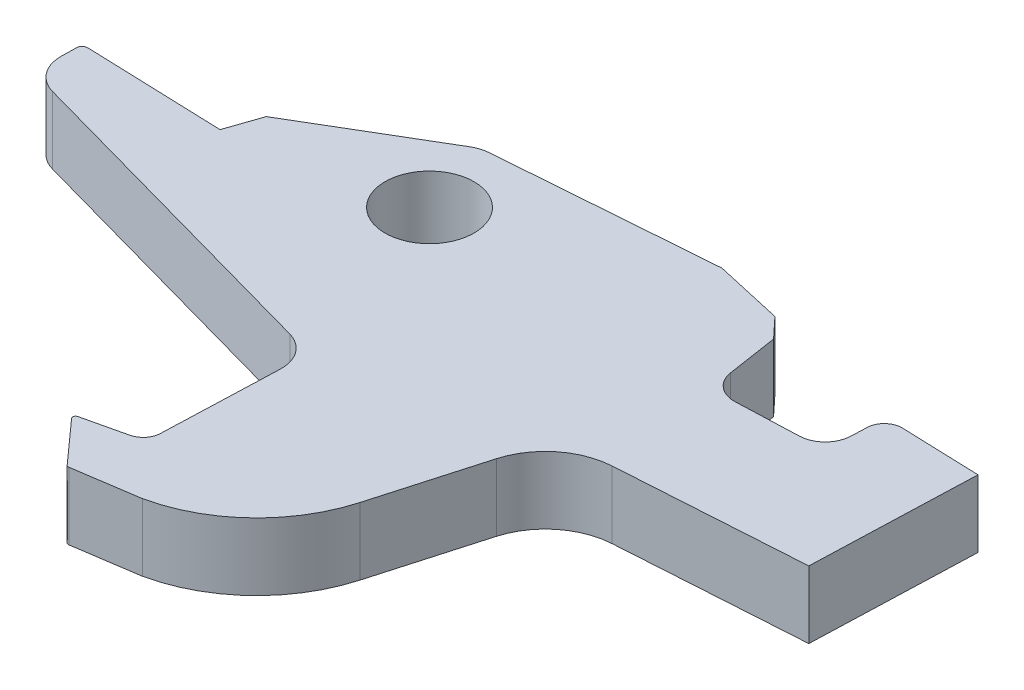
ISO-10303-21;
HEADER;
FILE_DESCRIPTION(('STEP AP214'),'2;1');
FILE_NAME('part.step','',(''),(''),'','','');
FILE_SCHEMA(('AUTOMOTIVE_DESIGN { 1 0 10303 214 1 1 1 1 }'));
ENDSEC;
DATA;
#1=APPLICATION_CONTEXT('core data for automotive mechanical design processes');
#2=APPLICATION_PROTOCOL_DEFINITION('international standard','automotive_design',2000,#1);
#3=PRODUCT_CONTEXT('',#1,'mechanical');
#4=PRODUCT('Part','Part','',(#3));
#5=PRODUCT_RELATED_PRODUCT_CATEGORY('part','',(#4));
#6=PRODUCT_DEFINITION_FORMATION('','',#4);
#7=PRODUCT_DEFINITION_CONTEXT('part definition',#1,'design');
#8=PRODUCT_DEFINITION('design','',#6,#7);
#9=PRODUCT_DEFINITION_SHAPE('','',#8);
#10=(LENGTH_UNIT() NAMED_UNIT(*) SI_UNIT(.MILLI.,.METRE.));
#11=(NAMED_UNIT(*) PLANE_ANGLE_UNIT() SI_UNIT($,.RADIAN.));
#12=(NAMED_UNIT(*) SI_UNIT($,.STERADIAN.) SOLID_ANGLE_UNIT());
#13=UNCERTAINTY_MEASURE_WITH_UNIT(LENGTH_MEASURE(1.E-05),#10,'distance_accuracy_value','');
#14=(GEOMETRIC_REPRESENTATION_CONTEXT(3) GLOBAL_UNCERTAINTY_ASSIGNED_CONTEXT((#13)) GLOBAL_UNIT_ASSIGNED_CONTEXT((#10,
#11,#12)) REPRESENTATION_CONTEXT('',''));
#15=CARTESIAN_POINT('',(0.,0.,0.));
#16=DIRECTION('',(0.,0.,1.));
#17=DIRECTION('',(1.,0.,0.));
#18=AXIS2_PLACEMENT_3D('',#15,#16,#17);
#19=CARTESIAN_POINT('',(-14.0248582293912,1.4986,1.70336053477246));
#20=DIRECTION('',(-0.999851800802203,0.,-0.0172155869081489));
#21=DIRECTION('',(-0.0172155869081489,0.,0.999851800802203));
#22=AXIS2_PLACEMENT_3D('',#19,#20,#21);
#23=PLANE('',#22);
#24=DIRECTION('',(-0.0172155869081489,0.,0.999851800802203));
#25=VECTOR('',#24,1.);
#26=CARTESIAN_POINT('',(-14.0248582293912,1.4986,1.70336053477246));
#27=LINE('',#26,#25);
#28=CARTESIAN_POINT('',(-14.0362916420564,1.4986,2.36739355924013));
#29=VERTEX_POINT('',#28);
#30=CARTESIAN_POINT('',(-14.0248582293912,1.4986,1.70336053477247));
#31=VERTEX_POINT('',#30);
#32=EDGE_CURVE('E227',#29,#31,#27,.F.);
#33=ORIENTED_EDGE('',*,*,#32,.T.);
#34=DIRECTION('',(0.,1.,0.));
#35=VECTOR('',#34,1.);
#36=CARTESIAN_POINT('',(-14.0248582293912,0.,1.70336053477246));
#37=LINE('',#36,#35);
#38=CARTESIAN_POINT('',(-14.0248582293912,-1.4986,1.70336053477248));
#39=VERTEX_POINT('',#38);
#40=EDGE_CURVE('E144',#39,#31,#37,.T.);
#41=ORIENTED_EDGE('',*,*,#40,.F.);
#42=DIRECTION('',(-0.0172155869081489,0.,0.999851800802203));
#43=VECTOR('',#42,1.);
#44=CARTESIAN_POINT('',(-14.0248582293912,-1.4986,1.70336053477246));
#45=LINE('',#44,#43);
#46=CARTESIAN_POINT('',(-14.0362916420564,-1.4986,2.36739355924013));
#47=VERTEX_POINT('',#46);
#48=EDGE_CURVE('E229',#39,#47,#45,.T.);
#49=ORIENTED_EDGE('',*,*,#48,.T.);
#50=DIRECTION('',(0.,-1.,0.));
#51=VECTOR('',#50,1.);
#52=CARTESIAN_POINT('',(-14.0362916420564,0.,2.3673935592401));
#53=LINE('',#52,#51);
#54=EDGE_CURVE('E141',#29,#47,#53,.T.);
#55=ORIENTED_EDGE('',*,*,#54,.F.);
#56=EDGE_LOOP('',(#33,#41,#49,#55));
#57=FACE_BOUND('',#56,.T.);
#58=ADVANCED_FACE('F16',(#57),#23,.T.);
#59=CARTESIAN_POINT('',(18.240471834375,1.4986,-1.25608519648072));
#60=DIRECTION('',(-0.999390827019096,0.,-0.034899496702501));
#61=DIRECTION('',(-0.034899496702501,0.,0.999390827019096));
#62=AXIS2_PLACEMENT_3D('',#59,#60,#61);
#63=PLANE('',#62);
#64=DIRECTION('',(-0.034899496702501,0.,0.999390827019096));
#65=VECTOR('',#64,1.);
#66=CARTESIAN_POINT('',(18.240471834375,1.4986,-1.25608519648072));
#67=LINE('',#66,#65);
#68=CARTESIAN_POINT('',(18.2163151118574,1.4986,-0.56432717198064));
#69=VERTEX_POINT('',#68);
#70=CARTESIAN_POINT('',(18.240471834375,1.4986,-1.25608519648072));
#71=VERTEX_POINT('',#70);
#72=EDGE_CURVE('E124',#69,#71,#67,.F.);
#73=ORIENTED_EDGE('',*,*,#72,.T.);
#74=DIRECTION('',(0.,1.,0.));
#75=VECTOR('',#74,1.);
#76=CARTESIAN_POINT('',(18.240471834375,0.,-1.25608519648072));
#77=LINE('',#76,#75);
#78=CARTESIAN_POINT('',(18.240471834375,-1.4986,-1.25608519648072));
#79=VERTEX_POINT('',#78);
#80=EDGE_CURVE('E136',#79,#71,#77,.T.);
#81=ORIENTED_EDGE('',*,*,#80,.F.);
#82=DIRECTION('',(-0.034899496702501,0.,0.999390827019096));
#83=VECTOR('',#82,1.);
#84=CARTESIAN_POINT('',(18.240471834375,-1.4986,-1.25608519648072));
#85=LINE('',#84,#83);
#86=CARTESIAN_POINT('',(18.2163151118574,-1.4986,-0.56432717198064));
#87=VERTEX_POINT('',#86);
#88=EDGE_CURVE('E138',#79,#87,#85,.T.);
#89=ORIENTED_EDGE('',*,*,#88,.T.);
#90=DIRECTION('',(0.,-1.,0.));
#91=VECTOR('',#90,1.);
#92=CARTESIAN_POINT('',(18.2163151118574,0.,-0.564327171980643));
#93=LINE('',#92,#91);
#94=EDGE_CURVE('E137',#69,#87,#93,.T.);
#95=ORIENTED_EDGE('',*,*,#94,.F.);
#96=EDGE_LOOP('',(#73,#81,#89,#95));
#97=FACE_BOUND('',#96,.T.);
#98=ADVANCED_FACE('F134',(#97),#63,.T.);
#99=CARTESIAN_POINT('',(19.0337383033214,1.49860000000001,-1.22838372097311));
#100=DIRECTION('',(0.,-1.,0.));
#101=DIRECTION('',(0.,0.,-1.));
#102=AXIS2_PLACEMENT_3D('',#99,#100,#101);
#103=CYLINDRICAL_SURFACE('',#102,0.793749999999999);
#104=DIRECTION('',(0.,1.,0.));
#105=VECTOR('',#104,1.);
#106=CARTESIAN_POINT('',(19.061439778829,1.4986,-2.02165018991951));
#107=LINE('',#106,#105);
#108=CARTESIAN_POINT('',(19.061439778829,-1.4986,-2.02165018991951));
#109=VERTEX_POINT('',#108);
#110=CARTESIAN_POINT('',(19.061439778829,1.4986,-2.02165018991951));
#111=VERTEX_POINT('',#110);
#112=EDGE_CURVE('E175',#109,#111,#107,.T.);
#113=ORIENTED_EDGE('',*,*,#112,.F.);
#114=CARTESIAN_POINT('',(19.0337383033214,-1.4986,-1.22838372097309));
#115=DIRECTION('',(0.,-1.,0.));
#116=DIRECTION('',(0.,0.,-1.));
#117=AXIS2_PLACEMENT_3D('',#114,#115,#116);
#118=CIRCLE('',#117,0.793749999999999);
#119=EDGE_CURVE('E20',#109,#79,#118,.F.);
#120=ORIENTED_EDGE('',*,*,#119,.T.);
#121=ORIENTED_EDGE('',*,*,#80,.T.);
#122=CARTESIAN_POINT('',(19.0337383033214,1.49860000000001,-1.22838372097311));
#123=DIRECTION('',(0.,-1.,0.));
#124=DIRECTION('',(0.,0.,-1.));
#125=AXIS2_PLACEMENT_3D('',#122,#123,#124);
#126=CIRCLE('',#125,0.793749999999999);
#127=EDGE_CURVE('E119',#111,#71,#126,.F.);
#128=ORIENTED_EDGE('',*,*,#127,.F.);
#129=EDGE_LOOP('',(#113,#120,#121,#128));
#130=FACE_BOUND('',#129,.T.);
#131=ADVANCED_FACE('F140',(#130),#103,.T.);
#132=CARTESIAN_POINT('',(1.97043333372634,1.4986,17.9349846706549));
#133=DIRECTION('',(0.,-1.,0.));
#134=DIRECTION('',(0.,0.,-1.));
#135=AXIS2_PLACEMENT_3D('',#132,#133,#134);
#136=CYLINDRICAL_SURFACE('',#135,0.127000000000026);
#137=DIRECTION('',(0.,1.,0.));
#138=VECTOR('',#137,1.);
#139=CARTESIAN_POINT('',(1.87588424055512,1.4986,18.0197754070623));
#140=LINE('',#139,#138);
#141=CARTESIAN_POINT('',(1.87588424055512,-1.49860000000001,18.0197754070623));
#142=VERTEX_POINT('',#141);
#143=CARTESIAN_POINT('',(1.87588424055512,1.4986,18.0197754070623));
#144=VERTEX_POINT('',#143);
#145=EDGE_CURVE('E363',#142,#144,#140,.T.);
#146=ORIENTED_EDGE('',*,*,#145,.F.);
#147=CARTESIAN_POINT('',(1.97043333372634,-1.49860000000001,17.9349846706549));
#148=DIRECTION('',(0.,-1.,0.));
#149=DIRECTION('',(0.,0.,-1.));
#150=AXIS2_PLACEMENT_3D('',#147,#148,#149);
#151=CIRCLE('',#150,0.127000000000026);
#152=CARTESIAN_POINT('',(1.98924094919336,-1.49860000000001,18.0605843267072));
#153=VERTEX_POINT('',#152);
#154=EDGE_CURVE('E215',#142,#153,#151,.F.);
#155=ORIENTED_EDGE('',*,*,#154,.T.);
#156=DIRECTION('',(0.,1.,0.));
#157=VECTOR('',#156,1.);
#158=CARTESIAN_POINT('',(1.98924094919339,1.4986,18.0605843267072));
#159=LINE('',#158,#157);
#160=CARTESIAN_POINT('',(1.98924094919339,1.4986,18.0605843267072));
#161=VERTEX_POINT('',#160);
#162=EDGE_CURVE('E367',#161,#153,#159,.F.);
#163=ORIENTED_EDGE('',*,*,#162,.F.);
#164=CARTESIAN_POINT('',(1.97043333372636,1.49859999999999,17.934984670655));
#165=DIRECTION('',(0.,-1.,0.));
#166=DIRECTION('',(0.,0.,-1.));
#167=AXIS2_PLACEMENT_3D('',#164,#165,#166);
#168=CIRCLE('',#167,0.126999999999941);
#169=EDGE_CURVE('E172',#144,#161,#168,.F.);
#170=ORIENTED_EDGE('',*,*,#169,.F.);
#171=EDGE_LOOP('',(#146,#155,#163,#170));
#172=FACE_BOUND('',#171,.T.);
#173=ADVANCED_FACE('F550',(#172),#136,.T.);
#174=CARTESIAN_POINT('',(0.262221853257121,1.4986,16.0301793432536));
#175=DIRECTION('',(0.,-1.,0.));
#176=DIRECTION('',(0.,0.,-1.));
#177=AXIS2_PLACEMENT_3D('',#174,#175,#176);
#178=CYLINDRICAL_SURFACE('',#177,0.127000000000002);
#179=DIRECTION('',(0.,1.,0.));
#180=VECTOR('',#179,1.);
#181=CARTESIAN_POINT('',(0.23332514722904,1.4986,15.9065105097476));
#182=LINE('',#181,#180);
#183=CARTESIAN_POINT('',(0.233325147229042,-1.49860000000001,15.9065105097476));
#184=VERTEX_POINT('',#183);
#185=CARTESIAN_POINT('',(0.233325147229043,1.4986,15.9065105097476));
#186=VERTEX_POINT('',#185);
#187=EDGE_CURVE('E358',#184,#186,#182,.T.);
#188=ORIENTED_EDGE('',*,*,#187,.F.);
#189=CARTESIAN_POINT('',(0.262221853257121,-1.49860000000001,16.0301793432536));
#190=DIRECTION('',(0.,-1.,0.));
#191=DIRECTION('',(0.,0.,-1.));
#192=AXIS2_PLACEMENT_3D('',#189,#190,#191);
#193=CIRCLE('',#192,0.127000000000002);
#194=CARTESIAN_POINT('',(0.16767276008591,-1.49860000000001,16.1149700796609));
#195=VERTEX_POINT('',#194);
#196=EDGE_CURVE('E214',#184,#195,#193,.F.);
#197=ORIENTED_EDGE('',*,*,#196,.T.);
#198=DIRECTION('',(0.,1.,0.));
#199=VECTOR('',#198,1.);
#200=CARTESIAN_POINT('',(0.167672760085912,1.4986,16.1149700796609));
#201=LINE('',#200,#199);
#202=CARTESIAN_POINT('',(0.16767276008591,1.4986,16.1149700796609));
#203=VERTEX_POINT('',#202);
#204=EDGE_CURVE('E362',#203,#195,#201,.F.);
#205=ORIENTED_EDGE('',*,*,#204,.F.);
#206=CARTESIAN_POINT('',(0.262221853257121,1.4986,16.0301793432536));
#207=DIRECTION('',(0.,-1.,0.));
#208=DIRECTION('',(0.,0.,-1.));
#209=AXIS2_PLACEMENT_3D('',#206,#207,#208);
#210=CIRCLE('',#209,0.127000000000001);
#211=EDGE_CURVE('E176',#186,#203,#210,.F.);
#212=ORIENTED_EDGE('',*,*,#211,.F.);
#213=EDGE_LOOP('',(#188,#197,#205,#212));
#214=FACE_BOUND('',#213,.T.);
#215=ADVANCED_FACE('F544',(#214),#178,.T.);
#216=CARTESIAN_POINT('',(1.93628762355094,1.4986,14.6934623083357));
#217=DIRECTION('',(0.,-1.,0.));
#218=DIRECTION('',(0.,0.,-1.));
#219=AXIS2_PLACEMENT_3D('',#216,#217,#218);
#220=CYLINDRICAL_SURFACE('',#219,0.793750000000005);
#221=DIRECTION('',(0.,1.,0.));
#222=VECTOR('',#221,1.);
#223=CARTESIAN_POINT('',(2.72951488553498,1.4986,14.7222646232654));
#224=LINE('',#223,#222);
#225=CARTESIAN_POINT('',(2.72951488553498,-1.49860000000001,14.7222646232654));
#226=VERTEX_POINT('',#225);
#227=CARTESIAN_POINT('',(2.72951488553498,1.4986,14.7222646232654));
#228=VERTEX_POINT('',#227);
#229=EDGE_CURVE('E353',#226,#228,#224,.T.);
#230=ORIENTED_EDGE('',*,*,#229,.F.);
#231=CARTESIAN_POINT('',(1.93628762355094,-1.49860000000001,14.6934623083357));
#232=DIRECTION('',(0.,-1.,0.));
#233=DIRECTION('',(0.,0.,-1.));
#234=AXIS2_PLACEMENT_3D('',#231,#232,#233);
#235=CIRCLE('',#234,0.793750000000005);
#236=CARTESIAN_POINT('',(2.11689203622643,-1.49860000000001,15.466392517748));
#237=VERTEX_POINT('',#236);
#238=EDGE_CURVE('E212',#226,#237,#235,.T.);
#239=ORIENTED_EDGE('',*,*,#238,.T.);
#240=DIRECTION('',(0.,1.,0.));
#241=VECTOR('',#240,1.);
#242=CARTESIAN_POINT('',(2.11689203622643,1.4986,15.466392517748));
#243=LINE('',#242,#241);
#244=CARTESIAN_POINT('',(2.11689203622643,1.4986,15.466392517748));
#245=VERTEX_POINT('',#244);
#246=EDGE_CURVE('E357',#245,#237,#243,.F.);
#247=ORIENTED_EDGE('',*,*,#246,.F.);
#248=CARTESIAN_POINT('',(1.93628762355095,1.4986,14.6934623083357));
#249=DIRECTION('',(0.,-1.,0.));
#250=DIRECTION('',(0.,0.,-1.));
#251=AXIS2_PLACEMENT_3D('',#248,#249,#250);
#252=CIRCLE('',#251,0.793749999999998);
#253=EDGE_CURVE('E179',#228,#245,#252,.T.);
#254=ORIENTED_EDGE('',*,*,#253,.F.);
#255=EDGE_LOOP('',(#230,#239,#247,#254));
#256=FACE_BOUND('',#255,.T.);
#257=ADVANCED_FACE('F532',(#256),#220,.F.);
#258=CARTESIAN_POINT('',(1.34677931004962,1.4986,9.50915039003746));
#259=DIRECTION('',(0.,-1.,0.));
#260=DIRECTION('',(0.,0.,-1.));
#261=AXIS2_PLACEMENT_3D('',#258,#259,#260);
#262=CYLINDRICAL_SURFACE('',#261,1.57099000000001);
#263=DIRECTION('',(0.,1.,0.));
#264=VECTOR('',#263,1.);
#265=CARTESIAN_POINT('',(1.77146006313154,1.4986,7.99665052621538));
#266=LINE('',#265,#264);
#267=CARTESIAN_POINT('',(1.77146006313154,-1.49860000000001,7.99665052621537));
#268=VERTEX_POINT('',#267);
#269=CARTESIAN_POINT('',(1.77146006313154,1.4986,7.99665052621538));
#270=VERTEX_POINT('',#269);
#271=EDGE_CURVE('E348',#268,#270,#266,.T.);
#272=ORIENTED_EDGE('',*,*,#271,.F.);
#273=CARTESIAN_POINT('',(1.34677931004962,-1.49860000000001,9.50915039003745));
#274=DIRECTION('',(0.,-1.,0.));
#275=DIRECTION('',(0.,0.,-1.));
#276=AXIS2_PLACEMENT_3D('',#273,#274,#275);
#277=CIRCLE('',#276,1.57099000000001);
#278=CARTESIAN_POINT('',(2.91673470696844,-1.49860000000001,9.56615593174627));
#279=VERTEX_POINT('',#278);
#280=EDGE_CURVE('E210',#268,#279,#277,.T.);
#281=ORIENTED_EDGE('',*,*,#280,.T.);
#282=DIRECTION('',(0.,1.,0.));
#283=VECTOR('',#282,1.);
#284=CARTESIAN_POINT('',(2.91673470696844,1.4986,9.56615593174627));
#285=LINE('',#284,#283);
#286=CARTESIAN_POINT('',(2.91673470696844,1.4986,9.56615593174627));
#287=VERTEX_POINT('',#286);
#288=EDGE_CURVE('E352',#287,#279,#285,.F.);
#289=ORIENTED_EDGE('',*,*,#288,.F.);
#290=CARTESIAN_POINT('',(1.34677931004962,1.4986,9.50915039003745));
#291=DIRECTION('',(0.,-1.,0.));
#292=DIRECTION('',(1.,0.,0.));
#293=AXIS2_PLACEMENT_3D('',#290,#291,#292);
#294=CIRCLE('',#293,1.57099000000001);
#295=EDGE_CURVE('E182',#270,#287,#294,.T.);
#296=ORIENTED_EDGE('',*,*,#295,.F.);
#297=EDGE_LOOP('',(#272,#281,#289,#296));
#298=FACE_BOUND('',#297,.T.);
#299=ADVANCED_FACE('F524',(#298),#262,.F.);
#300=CARTESIAN_POINT('',(-12.4490269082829,1.4986,2.39472330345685));
#301=DIRECTION('',(0.,-1.,0.));
#302=DIRECTION('',(0.,0.,-1.));
#303=AXIS2_PLACEMENT_3D('',#300,#301,#302);
#304=CYLINDRICAL_SURFACE('',#303,1.5875);
#305=CARTESIAN_POINT('',(-12.4490269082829,-1.4986,2.39472330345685));
#306=DIRECTION('',(0.,-1.,0.));
#307=DIRECTION('',(0.,0.,-1.));
#308=AXIS2_PLACEMENT_3D('',#305,#306,#307);
#309=CIRCLE('',#308,1.5875);
#310=CARTESIAN_POINT('',(-12.874317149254,-1.4986,3.92419525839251));
#311=VERTEX_POINT('',#310);
#312=EDGE_CURVE('E208',#47,#311,#309,.F.);
#313=ORIENTED_EDGE('',*,*,#312,.T.);
#314=DIRECTION('',(0.,1.,0.));
#315=VECTOR('',#314,1.);
#316=CARTESIAN_POINT('',(-12.874317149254,1.4986,3.92419525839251));
#317=LINE('',#316,#315);
#318=CARTESIAN_POINT('',(-12.874317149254,1.4986,3.92419525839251));
#319=VERTEX_POINT('',#318);
#320=EDGE_CURVE('E255',#319,#311,#317,.F.);
#321=ORIENTED_EDGE('',*,*,#320,.F.);
#322=CARTESIAN_POINT('',(-12.4490269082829,1.4986,2.39472330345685));
#323=DIRECTION('',(0.,-1.,0.));
#324=DIRECTION('',(0.,0.,-1.));
#325=AXIS2_PLACEMENT_3D('',#322,#323,#324);
#326=CIRCLE('',#325,1.5875);
#327=EDGE_CURVE('E185',#29,#319,#326,.F.);
#328=ORIENTED_EDGE('',*,*,#327,.F.);
#329=ORIENTED_EDGE('',*,*,#54,.T.);
#330=EDGE_LOOP('',(#313,#321,#328,#329));
#331=FACE_BOUND('',#330,.T.);
#332=ADVANCED_FACE('F251',(#331),#304,.T.);
#333=CARTESIAN_POINT('',(-13.7708958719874,1.4986,1.70773329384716));
#334=DIRECTION('',(0.,-1.,0.));
#335=DIRECTION('',(0.,0.,-1.));
#336=AXIS2_PLACEMENT_3D('',#333,#334,#335);
#337=CYLINDRICAL_SURFACE('',#336,0.254000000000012);
#338=DIRECTION('',(0.,1.,0.));
#339=VECTOR('',#338,1.);
#340=CARTESIAN_POINT('',(-13.7620312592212,1.4986,1.45388802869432));
#341=LINE('',#340,#339);
#342=CARTESIAN_POINT('',(-13.7620312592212,-1.4986,1.45388802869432));
#343=VERTEX_POINT('',#342);
#344=CARTESIAN_POINT('',(-13.7620312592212,1.4986,1.45388802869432));
#345=VERTEX_POINT('',#344);
#346=EDGE_CURVE('E244',#343,#345,#341,.T.);
#347=ORIENTED_EDGE('',*,*,#346,.F.);
#348=CARTESIAN_POINT('',(-13.7708958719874,-1.4986,1.70773329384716));
#349=DIRECTION('',(0.,-1.,0.));
#350=DIRECTION('',(0.,0.,-1.));
#351=AXIS2_PLACEMENT_3D('',#348,#349,#350);
#352=CIRCLE('',#351,0.254000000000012);
#353=EDGE_CURVE('E206',#343,#39,#352,.F.);
#354=ORIENTED_EDGE('',*,*,#353,.T.);
#355=ORIENTED_EDGE('',*,*,#40,.T.);
#356=CARTESIAN_POINT('',(-13.7708958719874,1.4986,1.70773329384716));
#357=DIRECTION('',(0.,-1.,0.));
#358=DIRECTION('',(0.,0.,-1.));
#359=AXIS2_PLACEMENT_3D('',#356,#357,#358);
#360=CIRCLE('',#359,0.254000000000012);
#361=EDGE_CURVE('E188',#345,#31,#360,.F.);
#362=ORIENTED_EDGE('',*,*,#361,.F.);
#363=EDGE_LOOP('',(#347,#354,#355,#362));
#364=FACE_BOUND('',#363,.T.);
#365=ADVANCED_FACE('F239',(#364),#337,.T.);
#366=CARTESIAN_POINT('',(-7.13932422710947,1.4986,0.133090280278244));
#367=DIRECTION('',(-0.945734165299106,0.,-0.324941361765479));
#368=DIRECTION('',(-0.324941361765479,0.,0.945734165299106));
#369=AXIS2_PLACEMENT_3D('',#366,#367,#368);
#370=PLANE('',#369);
#371=DIRECTION('',(-0.324941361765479,0.,0.945734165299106));
#372=VECTOR('',#371,1.);
#373=CARTESIAN_POINT('',(-7.13932422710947,1.49860000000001,0.133090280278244));
#374=LINE('',#373,#372);
#375=CARTESIAN_POINT('',(-7.13932422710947,1.4986,0.133090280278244));
#376=VERTEX_POINT('',#375);
#377=CARTESIAN_POINT('',(-7.66627222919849,1.4986,1.66676000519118));
#378=VERTEX_POINT('',#377);
#379=EDGE_CURVE('E190',#376,#378,#374,.T.);
#380=ORIENTED_EDGE('',*,*,#379,.F.);
#381=DIRECTION('',(0.,1.,0.));
#382=VECTOR('',#381,1.);
#383=CARTESIAN_POINT('',(-7.13932422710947,1.4986,0.133090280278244));
#384=LINE('',#383,#382);
#385=CARTESIAN_POINT('',(-7.13932422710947,-1.4986,0.133090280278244));
#386=VERTEX_POINT('',#385);
#387=EDGE_CURVE('E330',#386,#376,#384,.T.);
#388=ORIENTED_EDGE('',*,*,#387,.F.);
#389=DIRECTION('',(-0.324941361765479,0.,0.945734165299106));
#390=VECTOR('',#389,1.);
#391=CARTESIAN_POINT('',(-7.13932422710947,-1.4986,0.133090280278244));
#392=LINE('',#391,#390);
#393=CARTESIAN_POINT('',(-7.66627222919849,-1.4986,1.66676000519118));
#394=VERTEX_POINT('',#393);
#395=EDGE_CURVE('E205',#386,#394,#392,.T.);
#396=ORIENTED_EDGE('',*,*,#395,.T.);
#397=DIRECTION('',(0.,1.,0.));
#398=VECTOR('',#397,1.);
#399=CARTESIAN_POINT('',(-7.66627222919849,1.4986,1.66676000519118));
#400=LINE('',#399,#398);
#401=EDGE_CURVE('E344',#378,#394,#400,.F.);
#402=ORIENTED_EDGE('',*,*,#401,.F.);
#403=EDGE_LOOP('',(#380,#388,#396,#402));
#404=FACE_BOUND('',#403,.T.);
#405=ADVANCED_FACE('F650',(#404),#370,.T.);
#406=CARTESIAN_POINT('',(-0.650340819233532,1.49860000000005,-1.86017942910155));
#407=DIRECTION('',(0.,-1.,0.));
#408=DIRECTION('',(0.,0.,-1.));
#409=AXIS2_PLACEMENT_3D('',#406,#407,#408);
#410=CYLINDRICAL_SURFACE('',#409,1.58750000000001);
#411=DIRECTION('',(0.,1.,0.));
#412=VECTOR('',#411,1.);
#413=CARTESIAN_POINT('',(-0.770287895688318,1.4986,-3.44314150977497));
#414=LINE('',#413,#412);
#415=CARTESIAN_POINT('',(-0.770287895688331,-1.4986,-3.44314150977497));
#416=VERTEX_POINT('',#415);
#417=CARTESIAN_POINT('',(-0.770287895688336,1.4986,-3.44314150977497));
#418=VERTEX_POINT('',#417);
#419=EDGE_CURVE('E317',#416,#418,#414,.T.);
#420=ORIENTED_EDGE('',*,*,#419,.F.);
#421=CARTESIAN_POINT('',(-0.650340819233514,-1.49859999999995,-1.86017942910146));
#422=DIRECTION('',(0.,-1.,0.));
#423=DIRECTION('',(0.,0.,-1.));
#424=AXIS2_PLACEMENT_3D('',#421,#422,#423);
#425=CIRCLE('',#424,1.58750000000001);
#426=CARTESIAN_POINT('',(-1.4584502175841,-1.4986,-3.22660375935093));
#427=VERTEX_POINT('',#426);
#428=EDGE_CURVE('E203',#416,#427,#425,.F.);
#429=ORIENTED_EDGE('',*,*,#428,.T.);
#430=DIRECTION('',(0.,1.,0.));
#431=VECTOR('',#430,1.);
#432=CARTESIAN_POINT('',(-1.45845021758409,1.4986,-3.22660375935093));
#433=LINE('',#432,#431);
#434=CARTESIAN_POINT('',(-1.4584502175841,1.4986,-3.22660375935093));
#435=VERTEX_POINT('',#434);
#436=EDGE_CURVE('E329',#435,#427,#433,.F.);
#437=ORIENTED_EDGE('',*,*,#436,.F.);
#438=CARTESIAN_POINT('',(-0.650340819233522,1.49860000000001,-1.86017942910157));
#439=DIRECTION('',(0.,-1.,0.));
#440=DIRECTION('',(0.,0.,-1.));
#441=AXIS2_PLACEMENT_3D('',#438,#439,#440);
#442=CIRCLE('',#441,1.5875);
#443=EDGE_CURVE('E191',#418,#435,#442,.F.);
#444=ORIENTED_EDGE('',*,*,#443,.F.);
#445=EDGE_LOOP('',(#420,#429,#437,#444));
#446=FACE_BOUND('',#445,.T.);
#447=ADVANCED_FACE('F648',(#446),#410,.T.);
#448=CARTESIAN_POINT('',(12.7466497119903,1.4986,-2.58329703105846));
#449=DIRECTION('',(0.731353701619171,0.,-0.681998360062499));
#450=DIRECTION('',(-0.681998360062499,0.,-0.731353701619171));
#451=AXIS2_PLACEMENT_3D('',#448,#449,#450);
#452=PLANE('',#451);
#453=DIRECTION('',(-0.681998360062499,0.,-0.73135370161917));
#454=VECTOR('',#453,1.);
#455=CARTESIAN_POINT('',(12.7466497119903,1.49860000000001,-2.58329703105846));
#456=LINE('',#455,#454);
#457=CARTESIAN_POINT('',(12.7466497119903,1.4986,-2.58329703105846));
#458=VERTEX_POINT('',#457);
#459=CARTESIAN_POINT('',(11.9060495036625,1.4986,-3.48473039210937));
#460=VERTEX_POINT('',#459);
#461=EDGE_CURVE('E194',#458,#460,#456,.T.);
#462=ORIENTED_EDGE('',*,*,#461,.F.);
#463=DIRECTION('',(0.,1.,0.));
#464=VECTOR('',#463,1.);
#465=CARTESIAN_POINT('',(12.7466497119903,1.4986,-2.58329703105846));
#466=LINE('',#465,#464);
#467=CARTESIAN_POINT('',(12.7466497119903,-1.4986,-2.58329703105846));
#468=VERTEX_POINT('',#467);
#469=EDGE_CURVE('E302',#468,#458,#466,.T.);
#470=ORIENTED_EDGE('',*,*,#469,.F.);
#471=DIRECTION('',(-0.681998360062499,0.,-0.731353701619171));
#472=VECTOR('',#471,1.);
#473=CARTESIAN_POINT('',(12.7466497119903,-1.49860000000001,-2.58329703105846));
#474=LINE('',#473,#472);
#475=CARTESIAN_POINT('',(11.9060495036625,-1.49860000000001,-3.48473039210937));
#476=VERTEX_POINT('',#475);
#477=EDGE_CURVE('E202',#468,#476,#474,.T.);
#478=ORIENTED_EDGE('',*,*,#477,.T.);
#479=DIRECTION('',(0.,1.,0.));
#480=VECTOR('',#479,1.);
#481=CARTESIAN_POINT('',(11.9060495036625,1.4986,-3.48473039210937));
#482=LINE('',#481,#480);
#483=EDGE_CURVE('E323',#460,#476,#482,.F.);
#484=ORIENTED_EDGE('',*,*,#483,.F.);
#485=EDGE_LOOP('',(#462,#470,#478,#484));
#486=FACE_BOUND('',#485,.T.);
#487=ADVANCED_FACE('F645',(#486),#452,.T.);
#488=CARTESIAN_POINT('',(14.2691771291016,1.4986,-0.499187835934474));
#489=DIRECTION('',(0.,-1.,0.));
#490=DIRECTION('',(0.,0.,-1.));
#491=AXIS2_PLACEMENT_3D('',#488,#489,#490);
#492=CYLINDRICAL_SURFACE('',#491,1.19125999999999);
#493=DIRECTION('',(0.,1.,0.));
#494=VECTOR('',#493,1.);
#495=CARTESIAN_POINT('',(14.3152586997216,1.4986,0.691180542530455));
#496=LINE('',#495,#494);
#497=CARTESIAN_POINT('',(14.3152586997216,-1.4986,0.691180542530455));
#498=VERTEX_POINT('',#497);
#499=CARTESIAN_POINT('',(14.3152586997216,1.4986,0.691180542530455));
#500=VERTEX_POINT('',#499);
#501=EDGE_CURVE('E292',#498,#500,#496,.T.);
#502=ORIENTED_EDGE('',*,*,#501,.F.);
#503=CARTESIAN_POINT('',(14.2691771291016,-1.49860000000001,-0.499187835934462));
#504=DIRECTION('',(0.,-1.,0.));
#505=DIRECTION('',(0.,0.,-1.));
#506=AXIS2_PLACEMENT_3D('',#503,#504,#505);
#507=CIRCLE('',#506,1.19125999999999);
#508=CARTESIAN_POINT('',(13.0915065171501,-1.4986,-0.319765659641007));
#509=VERTEX_POINT('',#508);
#510=EDGE_CURVE('E200',#498,#509,#507,.T.);
#511=ORIENTED_EDGE('',*,*,#510,.T.);
#512=DIRECTION('',(0.,1.,0.));
#513=VECTOR('',#512,1.);
#514=CARTESIAN_POINT('',(13.0915065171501,1.4986,-0.319765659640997));
#515=LINE('',#514,#513);
#516=CARTESIAN_POINT('',(13.0915065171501,1.4986,-0.319765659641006));
#517=VERTEX_POINT('',#516);
#518=EDGE_CURVE('E294',#517,#509,#515,.F.);
#519=ORIENTED_EDGE('',*,*,#518,.F.);
#520=CARTESIAN_POINT('',(14.2691771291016,1.49860000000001,-0.499187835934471));
#521=DIRECTION('',(0.,-1.,0.));
#522=DIRECTION('',(0.,0.,-1.));
#523=AXIS2_PLACEMENT_3D('',#520,#521,#522);
#524=CIRCLE('',#523,1.19125999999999);
#525=EDGE_CURVE('E195',#500,#517,#524,.T.);
#526=ORIENTED_EDGE('',*,*,#525,.F.);
#527=EDGE_LOOP('',(#502,#511,#519,#526));
#528=FACE_BOUND('',#527,.T.);
#529=ADVANCED_FACE('F607',(#528),#492,.F.);
#530=CARTESIAN_POINT('',(17.0257807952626,1.4986,-0.605901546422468));
#531=DIRECTION('',(0.,-1.,0.));
#532=DIRECTION('',(0.,0.,-1.));
#533=AXIS2_PLACEMENT_3D('',#530,#531,#532);
#534=CYLINDRICAL_SURFACE('',#533,1.19126);
#535=CARTESIAN_POINT('',(17.0257807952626,-1.4986,-0.605901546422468));
#536=DIRECTION('',(0.,-1.,0.));
#537=DIRECTION('',(0.,0.,-1.));
#538=AXIS2_PLACEMENT_3D('',#535,#536,#537);
#539=CIRCLE('',#538,1.19126);
#540=CARTESIAN_POINT('',(17.0718623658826,-1.4986,0.584466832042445));
#541=VERTEX_POINT('',#540);
#542=EDGE_CURVE('E35',#87,#541,#539,.T.);
#543=ORIENTED_EDGE('',*,*,#542,.T.);
#544=DIRECTION('',(0.,1.,0.));
#545=VECTOR('',#544,1.);
#546=CARTESIAN_POINT('',(17.0718623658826,1.4986,0.584466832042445));
#547=LINE('',#546,#545);
#548=CARTESIAN_POINT('',(17.0718623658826,1.4986,0.584466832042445));
#549=VERTEX_POINT('',#548);
#550=EDGE_CURVE('E161',#549,#541,#547,.F.);
#551=ORIENTED_EDGE('',*,*,#550,.F.);
#552=CARTESIAN_POINT('',(17.0257807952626,1.4986,-0.605901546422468));
#553=DIRECTION('',(0.,-1.,0.));
#554=DIRECTION('',(0.,0.,-1.));
#555=AXIS2_PLACEMENT_3D('',#552,#553,#554);
#556=CIRCLE('',#555,1.19126);
#557=EDGE_CURVE('E130',#69,#549,#556,.T.);
#558=ORIENTED_EDGE('',*,*,#557,.F.);
#559=ORIENTED_EDGE('',*,*,#94,.T.);
#560=EDGE_LOOP('',(#543,#551,#558,#559));
#561=FACE_BOUND('',#560,.T.);
#562=ADVANCED_FACE('F285',(#561),#534,.F.);
#563=CARTESIAN_POINT('',(4.85720840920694,1.4986,5.4937935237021));
#564=DIRECTION('',(0.,1.,0.));
#565=DIRECTION('',(0.,0.,1.));
#566=AXIS2_PLACEMENT_3D('',#563,#564,#565);
#567=PLANE('',#566);
#568=CARTESIAN_POINT('',(0.,1.49860000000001,0.));
#569=DIRECTION('',(0.,-1.,0.));
#570=DIRECTION('',(0.,0.,-1.));
#571=AXIS2_PLACEMENT_3D('',#568,#569,#570);
#572=CIRCLE('',#571,1.984375);
#573=CARTESIAN_POINT('',(0.,1.49860000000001,-1.984375));
#574=VERTEX_POINT('',#573);
#575=EDGE_CURVE('E157',#574,#574,#572,.F.);
#576=ORIENTED_EDGE('',*,*,#575,.F.);
#577=EDGE_LOOP('',(#576));
#578=FACE_BOUND('',#577,.T.);
#579=CARTESIAN_POINT('',(14.2400443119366,1.4986,9.07937272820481));
#580=DIRECTION('',(0.,-1.,0.));
#581=DIRECTION('',(0.,0.,-1.));
#582=AXIS2_PLACEMENT_3D('',#579,#580,#581);
#583=CIRCLE('',#582,3.17499999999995);
#584=CARTESIAN_POINT('',(14.0379033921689,1.4986,5.91081405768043));
#585=VERTEX_POINT('',#584);
#586=CARTESIAN_POINT('',(11.1868478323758,1.4986,8.20838693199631));
#587=VERTEX_POINT('',#586);
#588=EDGE_CURVE('E167',#585,#587,#583,.F.);
#589=ORIENTED_EDGE('',*,*,#588,.F.);
#590=DIRECTION('',(0.997971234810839,0.,-0.0636664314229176));
#591=VECTOR('',#590,1.);
#592=CARTESIAN_POINT('',(14.0379033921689,1.4986,5.91081405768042));
#593=LINE('',#592,#591);
#594=CARTESIAN_POINT('',(22.2842668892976,1.4986,5.38473022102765));
#595=VERTEX_POINT('',#594);
#596=EDGE_CURVE('E371',#595,#585,#593,.F.);
#597=ORIENTED_EDGE('',*,*,#596,.F.);
#598=DIRECTION('',(0.034899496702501,0.,-0.999390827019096));
#599=VECTOR('',#598,1.);
#600=CARTESIAN_POINT('',(22.2842668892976,1.4986,5.38473022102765));
#601=LINE('',#600,#599);
#602=CARTESIAN_POINT('',(22.538663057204,1.4986,-1.90022287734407));
#603=VERTEX_POINT('',#602);
#604=EDGE_CURVE('E377',#603,#595,#601,.F.);
#605=ORIENTED_EDGE('',*,*,#604,.F.);
#606=DIRECTION('',(-0.999390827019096,0.,-0.0348994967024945));
#607=VECTOR('',#606,1.);
#608=CARTESIAN_POINT('',(22.538663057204,1.4986,-1.90022287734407));
#609=LINE('',#608,#607);
#610=EDGE_CURVE('E128',#111,#603,#609,.F.);
#611=ORIENTED_EDGE('',*,*,#610,.F.);
#612=ORIENTED_EDGE('',*,*,#127,.T.);
#613=ORIENTED_EDGE('',*,*,#72,.F.);
#614=ORIENTED_EDGE('',*,*,#557,.T.);
#615=DIRECTION('',(-0.999251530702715,0.,0.0386830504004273));
#616=VECTOR('',#615,1.);
#617=CARTESIAN_POINT('',(17.0718623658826,1.4986,0.584466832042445));
#618=LINE('',#617,#616);
#619=EDGE_CURVE('E283',#500,#549,#618,.F.);
#620=ORIENTED_EDGE('',*,*,#619,.F.);
#621=ORIENTED_EDGE('',*,*,#525,.T.);
#622=DIRECTION('',(-0.150615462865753,0.,-0.988592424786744));
#623=VECTOR('',#622,1.);
#624=CARTESIAN_POINT('',(13.0915065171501,1.4986,-0.319765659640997));
#625=LINE('',#624,#623);
#626=EDGE_CURVE('E299',#458,#517,#625,.F.);
#627=ORIENTED_EDGE('',*,*,#626,.F.);
#628=ORIENTED_EDGE('',*,*,#461,.T.);
#629=DIRECTION('',(-0.975469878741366,0.,-0.220132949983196));
#630=VECTOR('',#629,1.);
#631=CARTESIAN_POINT('',(11.9060495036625,1.4986,-3.48473039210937));
#632=LINE('',#631,#630);
#633=CARTESIAN_POINT('',(8.85755522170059,1.4986,-4.17267991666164));
#634=VERTEX_POINT('',#633);
#635=EDGE_CURVE('E320',#634,#460,#632,.F.);
#636=ORIENTED_EDGE('',*,*,#635,.F.);
#637=DIRECTION('',(-0.997141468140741,0.,0.0755572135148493));
#638=VECTOR('',#637,1.);
#639=CARTESIAN_POINT('',(8.85755522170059,1.4986,-4.17267991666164));
#640=LINE('',#639,#638);
#641=EDGE_CURVE('E313',#418,#634,#640,.F.);
#642=ORIENTED_EDGE('',*,*,#641,.F.);
#643=ORIENTED_EDGE('',*,*,#443,.T.);
#644=DIRECTION('',(-0.860739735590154,0.,0.509045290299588));
#645=VECTOR('',#644,1.);
#646=CARTESIAN_POINT('',(-1.45845021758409,1.4986,-3.22660375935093));
#647=LINE('',#646,#645);
#648=EDGE_CURVE('E326',#376,#435,#647,.F.);
#649=ORIENTED_EDGE('',*,*,#648,.F.);
#650=ORIENTED_EDGE('',*,*,#379,.T.);
#651=DIRECTION('',(-0.999390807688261,0.,-0.0349000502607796));
#652=VECTOR('',#651,1.);
#653=CARTESIAN_POINT('',(-7.66627222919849,1.4986,1.66676000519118));
#654=LINE('',#653,#652);
#655=EDGE_CURVE('E341',#345,#378,#654,.F.);
#656=ORIENTED_EDGE('',*,*,#655,.F.);
#657=ORIENTED_EDGE('',*,*,#361,.T.);
#658=ORIENTED_EDGE('',*,*,#32,.F.);
#659=ORIENTED_EDGE('',*,*,#327,.T.);
#660=DIRECTION('',(0.963446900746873,0.,0.267899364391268));
#661=VECTOR('',#660,1.);
#662=CARTESIAN_POINT('',(-12.874317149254,1.4986,3.92419525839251));
#663=LINE('',#662,#661);
#664=EDGE_CURVE('E259',#270,#319,#663,.F.);
#665=ORIENTED_EDGE('',*,*,#664,.F.);
#666=ORIENTED_EDGE('',*,*,#295,.T.);
#667=DIRECTION('',(-0.0362863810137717,0.,0.999341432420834));
#668=VECTOR('',#667,1.);
#669=CARTESIAN_POINT('',(2.91673470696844,1.4986,9.56615593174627));
#670=LINE('',#669,#668);
#671=EDGE_CURVE('E349',#228,#287,#670,.F.);
#672=ORIENTED_EDGE('',*,*,#671,.F.);
#673=ORIENTED_EDGE('',*,*,#253,.T.);
#674=DIRECTION('',(-0.973770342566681,0.,0.227533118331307));
#675=VECTOR('',#674,1.);
#676=CARTESIAN_POINT('',(2.11689203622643,1.4986,15.466392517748));
#677=LINE('',#676,#675);
#678=EDGE_CURVE('E354',#186,#245,#677,.F.);
#679=ORIENTED_EDGE('',*,*,#678,.F.);
#680=ORIENTED_EDGE('',*,*,#211,.T.);
#681=DIRECTION('',(0.667643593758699,0.,0.744481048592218));
#682=VECTOR('',#681,1.);
#683=CARTESIAN_POINT('',(0.167672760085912,1.4986,16.1149700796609));
#684=LINE('',#683,#682);
#685=EDGE_CURVE('E359',#144,#203,#684,.F.);
#686=ORIENTED_EDGE('',*,*,#685,.F.);
#687=ORIENTED_EDGE('',*,*,#169,.T.);
#688=DIRECTION('',(0.988973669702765,0.,-0.148091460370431));
#689=VECTOR('',#688,1.);
#690=CARTESIAN_POINT('',(1.98924094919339,1.4986,18.0605843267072));
#691=LINE('',#690,#689);
#692=CARTESIAN_POINT('',(4.85039553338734,1.4986,17.6321476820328));
#693=VERTEX_POINT('',#692);
#694=EDGE_CURVE('E364',#693,#161,#691,.F.);
#695=ORIENTED_EDGE('',*,*,#694,.F.);
#696=CARTESIAN_POINT('',(3.41613376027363,1.4986,11.1119540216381));
#697=DIRECTION('',(0.,-1.,0.));
#698=DIRECTION('',(0.,0.,-1.));
#699=AXIS2_PLACEMENT_3D('',#696,#697,#698);
#700=CIRCLE('',#699,6.67607910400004);
#701=CARTESIAN_POINT('',(9.836096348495,1.4986,12.9433776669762));
#702=VERTEX_POINT('',#701);
#703=EDGE_CURVE('E162',#702,#693,#700,.T.);
#704=ORIENTED_EDGE('',*,*,#703,.F.);
#705=DIRECTION('',(0.274326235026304,0.,-0.961636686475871));
#706=VECTOR('',#705,1.);
#707=CARTESIAN_POINT('',(9.836096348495,1.4986,12.9433776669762));
#708=LINE('',#707,#706);
#709=EDGE_CURVE('E368',#587,#702,#708,.F.);
#710=ORIENTED_EDGE('',*,*,#709,.F.);
#711=EDGE_LOOP('',(#589,#597,#605,#611,#612,#613,#614,#620,#621,#627,#628,#636,#642,#643,#649,
#650,#656,#657,#658,#659,#665,#666,#672,#673,#679,#680,#686,#687,#695,#704,#710));
#712=FACE_BOUND('',#711,.T.);
#713=ADVANCED_FACE('F122',(#578,#712),#567,.T.);
#714=CARTESIAN_POINT('',(22.538663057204,1.4986,-1.90022287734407));
#715=DIRECTION('',(0.0348994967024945,0.,-0.999390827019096));
#716=DIRECTION('',(-0.999390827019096,0.,-0.0348994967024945));
#717=AXIS2_PLACEMENT_3D('',#714,#715,#716);
#718=PLANE('',#717);
#719=ORIENTED_EDGE('',*,*,#610,.T.);
#720=DIRECTION('',(0.,1.,0.));
#721=VECTOR('',#720,1.);
#722=CARTESIAN_POINT('',(22.538663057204,1.4986,-1.90022287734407));
#723=LINE('',#722,#721);
#724=CARTESIAN_POINT('',(22.538663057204,-1.4986,-1.90022287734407));
#725=VERTEX_POINT('',#724);
#726=EDGE_CURVE('E380',#725,#603,#723,.T.);
#727=ORIENTED_EDGE('',*,*,#726,.F.);
#728=DIRECTION('',(0.999390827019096,0.,0.0348994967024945));
#729=VECTOR('',#728,1.);
#730=CARTESIAN_POINT('',(19.061439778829,-1.4986,-2.02165018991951));
#731=LINE('',#730,#729);
#732=EDGE_CURVE('E160',#109,#725,#731,.T.);
#733=ORIENTED_EDGE('',*,*,#732,.F.);
#734=ORIENTED_EDGE('',*,*,#112,.T.);
#735=EDGE_LOOP('',(#719,#727,#733,#734));
#736=FACE_BOUND('',#735,.T.);
#737=ADVANCED_FACE('F469',(#736),#718,.T.);
#738=CARTESIAN_POINT('',(22.2842668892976,1.4986,5.38473022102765));
#739=DIRECTION('',(0.999390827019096,0.,0.034899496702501));
#740=DIRECTION('',(0.034899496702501,0.,-0.999390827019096));
#741=AXIS2_PLACEMENT_3D('',#738,#739,#740);
#742=PLANE('',#741);
#743=ORIENTED_EDGE('',*,*,#604,.T.);
#744=DIRECTION('',(0.,1.,0.));
#745=VECTOR('',#744,1.);
#746=CARTESIAN_POINT('',(22.2842668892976,1.4986,5.38473022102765));
#747=LINE('',#746,#745);
#748=CARTESIAN_POINT('',(22.2842668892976,-1.49860000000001,5.38473022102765));
#749=VERTEX_POINT('',#748);
#750=EDGE_CURVE('E374',#749,#595,#747,.T.);
#751=ORIENTED_EDGE('',*,*,#750,.F.);
#752=DIRECTION('',(-0.0348994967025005,0.,0.999390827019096));
#753=VECTOR('',#752,1.);
#754=CARTESIAN_POINT('',(22.538663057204,-1.4986,-1.90022287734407));
#755=LINE('',#754,#753);
#756=EDGE_CURVE('E450',#725,#749,#755,.T.);
#757=ORIENTED_EDGE('',*,*,#756,.F.);
#758=ORIENTED_EDGE('',*,*,#726,.T.);
#759=EDGE_LOOP('',(#743,#751,#757,#758));
#760=FACE_BOUND('',#759,.T.);
#761=ADVANCED_FACE('F461',(#760),#742,.T.);
#762=CARTESIAN_POINT('',(14.0379033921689,1.4986,5.91081405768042));
#763=DIRECTION('',(0.0636664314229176,0.,0.997971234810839));
#764=DIRECTION('',(0.997971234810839,0.,-0.0636664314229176));
#765=AXIS2_PLACEMENT_3D('',#762,#763,#764);
#766=PLANE('',#765);
#767=ORIENTED_EDGE('',*,*,#596,.T.);
#768=DIRECTION('',(0.,1.,0.));
#769=VECTOR('',#768,1.);
#770=CARTESIAN_POINT('',(14.0379033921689,0.,5.91081405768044));
#771=LINE('',#770,#769);
#772=CARTESIAN_POINT('',(14.0379033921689,-1.49860000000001,5.91081405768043));
#773=VERTEX_POINT('',#772);
#774=EDGE_CURVE('E171',#773,#585,#771,.T.);
#775=ORIENTED_EDGE('',*,*,#774,.F.);
#776=DIRECTION('',(-0.997971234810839,0.,0.0636664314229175));
#777=VECTOR('',#776,1.);
#778=CARTESIAN_POINT('',(22.2842668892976,-1.49860000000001,5.38473022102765));
#779=LINE('',#778,#777);
#780=EDGE_CURVE('E156',#749,#773,#779,.T.);
#781=ORIENTED_EDGE('',*,*,#780,.F.);
#782=ORIENTED_EDGE('',*,*,#750,.T.);
#783=EDGE_LOOP('',(#767,#775,#781,#782));
#784=FACE_BOUND('',#783,.T.);
#785=ADVANCED_FACE('F570',(#784),#766,.T.);
#786=CARTESIAN_POINT('',(14.2400443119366,1.4986,9.07937272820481));
#787=DIRECTION('',(0.,-1.,0.));
#788=DIRECTION('',(0.,0.,-1.));
#789=AXIS2_PLACEMENT_3D('',#786,#787,#788);
#790=CYLINDRICAL_SURFACE('',#789,3.17499999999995);
#791=DIRECTION('',(0.,1.,0.));
#792=VECTOR('',#791,1.);
#793=CARTESIAN_POINT('',(11.1868478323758,1.4986,8.2083869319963));
#794=LINE('',#793,#792);
#795=CARTESIAN_POINT('',(11.1868478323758,-1.49860000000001,8.2083869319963));
#796=VERTEX_POINT('',#795);
#797=EDGE_CURVE('E170',#796,#587,#794,.T.);
#798=ORIENTED_EDGE('',*,*,#797,.F.);
#799=CARTESIAN_POINT('',(14.2400443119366,-1.49860000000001,9.07937272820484));
#800=DIRECTION('',(0.,-1.,0.));
#801=DIRECTION('',(0.,0.,-1.));
#802=AXIS2_PLACEMENT_3D('',#799,#800,#801);
#803=CIRCLE('',#802,3.17499999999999);
#804=EDGE_CURVE('E153',#773,#796,#803,.F.);
#805=ORIENTED_EDGE('',*,*,#804,.F.);
#806=ORIENTED_EDGE('',*,*,#774,.T.);
#807=ORIENTED_EDGE('',*,*,#588,.T.);
#808=EDGE_LOOP('',(#798,#805,#806,#807));
#809=FACE_BOUND('',#808,.T.);
#810=ADVANCED_FACE('F567',(#809),#790,.F.);
#811=CARTESIAN_POINT('',(9.836096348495,1.4986,12.9433776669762));
#812=DIRECTION('',(0.961636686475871,0.,0.274326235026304));
#813=DIRECTION('',(0.274326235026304,0.,-0.961636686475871));
#814=AXIS2_PLACEMENT_3D('',#811,#812,#813);
#815=PLANE('',#814);
#816=ORIENTED_EDGE('',*,*,#709,.T.);
#817=DIRECTION('',(0.,1.,0.));
#818=VECTOR('',#817,1.);
#819=CARTESIAN_POINT('',(9.836096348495,0.,12.9433776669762));
#820=LINE('',#819,#818);
#821=CARTESIAN_POINT('',(9.836096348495,-1.49860000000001,12.9433776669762));
#822=VERTEX_POINT('',#821);
#823=EDGE_CURVE('E166',#822,#702,#820,.T.);
#824=ORIENTED_EDGE('',*,*,#823,.F.);
#825=DIRECTION('',(-0.274326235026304,0.,0.961636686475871));
#826=VECTOR('',#825,1.);
#827=CARTESIAN_POINT('',(11.1868478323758,-1.49860000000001,8.2083869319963));
#828=LINE('',#827,#826);
#829=EDGE_CURVE('E152',#796,#822,#828,.T.);
#830=ORIENTED_EDGE('',*,*,#829,.F.);
#831=ORIENTED_EDGE('',*,*,#797,.T.);
#832=EDGE_LOOP('',(#816,#824,#830,#831));
#833=FACE_BOUND('',#832,.T.);
#834=ADVANCED_FACE('F562',(#833),#815,.T.);
#835=CARTESIAN_POINT('',(3.41613376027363,1.49860000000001,11.1119540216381));
#836=DIRECTION('',(0.,-1.,0.));
#837=DIRECTION('',(0.,0.,-1.));
#838=AXIS2_PLACEMENT_3D('',#835,#836,#837);
#839=CYLINDRICAL_SURFACE('',#838,6.67607910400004);
#840=DIRECTION('',(0.,1.,0.));
#841=VECTOR('',#840,1.);
#842=CARTESIAN_POINT('',(4.85039553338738,1.4986,17.6321476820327));
#843=LINE('',#842,#841);
#844=CARTESIAN_POINT('',(4.8503955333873,-1.49860000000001,17.6321476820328));
#845=VERTEX_POINT('',#844);
#846=EDGE_CURVE('E165',#845,#693,#843,.T.);
#847=ORIENTED_EDGE('',*,*,#846,.F.);
#848=CARTESIAN_POINT('',(3.41613376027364,-1.4986,11.1119540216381));
#849=DIRECTION('',(0.,-1.,0.));
#850=DIRECTION('',(1.,0.,0.));
#851=AXIS2_PLACEMENT_3D('',#848,#849,#850);
#852=CIRCLE('',#851,6.67607910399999);
#853=EDGE_CURVE('E148',#822,#845,#852,.T.);
#854=ORIENTED_EDGE('',*,*,#853,.F.);
#855=ORIENTED_EDGE('',*,*,#823,.T.);
#856=ORIENTED_EDGE('',*,*,#703,.T.);
#857=EDGE_LOOP('',(#847,#854,#855,#856));
#858=FACE_BOUND('',#857,.T.);
#859=ADVANCED_FACE('F558',(#858),#839,.T.);
#860=CARTESIAN_POINT('',(1.98924094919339,1.4986,18.0605843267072));
#861=DIRECTION('',(0.148091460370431,0.,0.988973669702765));
#862=DIRECTION('',(0.988973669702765,0.,-0.148091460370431));
#863=AXIS2_PLACEMENT_3D('',#860,#861,#862);
#864=PLANE('',#863);
#865=ORIENTED_EDGE('',*,*,#694,.T.);
#866=ORIENTED_EDGE('',*,*,#162,.T.);
#867=DIRECTION('',(-0.988973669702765,0.,0.14809146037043));
#868=VECTOR('',#867,1.);
#869=CARTESIAN_POINT('',(4.85039553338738,-1.49860000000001,17.6321476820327));
#870=LINE('',#869,#868);
#871=EDGE_CURVE('E151',#845,#153,#870,.T.);
#872=ORIENTED_EDGE('',*,*,#871,.F.);
#873=ORIENTED_EDGE('',*,*,#846,.T.);
#874=EDGE_LOOP('',(#865,#866,#872,#873));
#875=FACE_BOUND('',#874,.T.);
#876=ADVANCED_FACE('F554',(#875),#864,.T.);
#877=CARTESIAN_POINT('',(0.167672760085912,1.4986,16.1149700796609));
#878=DIRECTION('',(-0.744481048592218,0.,0.667643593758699));
#879=DIRECTION('',(0.667643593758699,0.,0.744481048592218));
#880=AXIS2_PLACEMENT_3D('',#877,#878,#879);
#881=PLANE('',#880);
#882=ORIENTED_EDGE('',*,*,#685,.T.);
#883=ORIENTED_EDGE('',*,*,#204,.T.);
#884=DIRECTION('',(-0.667643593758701,0.,-0.744481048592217));
#885=VECTOR('',#884,1.);
#886=CARTESIAN_POINT('',(1.87588424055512,-1.49860000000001,18.0197754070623));
#887=LINE('',#886,#885);
#888=EDGE_CURVE('E581',#142,#195,#887,.T.);
#889=ORIENTED_EDGE('',*,*,#888,.F.);
#890=ORIENTED_EDGE('',*,*,#145,.T.);
#891=EDGE_LOOP('',(#882,#883,#889,#890));
#892=FACE_BOUND('',#891,.T.);
#893=ADVANCED_FACE('F548',(#892),#881,.T.);
#894=CARTESIAN_POINT('',(2.11689203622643,1.4986,15.466392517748));
#895=DIRECTION('',(-0.227533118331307,0.,-0.973770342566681));
#896=DIRECTION('',(-0.973770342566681,0.,0.227533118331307));
#897=AXIS2_PLACEMENT_3D('',#894,#895,#896);
#898=PLANE('',#897);
#899=ORIENTED_EDGE('',*,*,#678,.T.);
#900=ORIENTED_EDGE('',*,*,#246,.T.);
#901=DIRECTION('',(0.973770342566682,0.,-0.227533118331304));
#902=VECTOR('',#901,1.);
#903=CARTESIAN_POINT('',(0.233325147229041,-1.49860000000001,15.9065105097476));
#904=LINE('',#903,#902);
#905=EDGE_CURVE('E542',#184,#237,#904,.T.);
#906=ORIENTED_EDGE('',*,*,#905,.F.);
#907=ORIENTED_EDGE('',*,*,#187,.T.);
#908=EDGE_LOOP('',(#899,#900,#906,#907));
#909=FACE_BOUND('',#908,.T.);
#910=ADVANCED_FACE('F540',(#909),#898,.T.);
#911=CARTESIAN_POINT('',(2.91673470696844,1.4986,9.56615593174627));
#912=DIRECTION('',(-0.999341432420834,0.,-0.0362863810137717));
#913=DIRECTION('',(-0.0362863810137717,0.,0.999341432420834));
#914=AXIS2_PLACEMENT_3D('',#911,#912,#913);
#915=PLANE('',#914);
#916=ORIENTED_EDGE('',*,*,#671,.T.);
#917=ORIENTED_EDGE('',*,*,#288,.T.);
#918=DIRECTION('',(0.0362863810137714,0.,-0.999341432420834));
#919=VECTOR('',#918,1.);
#920=CARTESIAN_POINT('',(2.72951488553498,-1.49860000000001,14.7222646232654));
#921=LINE('',#920,#919);
#922=EDGE_CURVE('E530',#226,#279,#921,.T.);
#923=ORIENTED_EDGE('',*,*,#922,.F.);
#924=ORIENTED_EDGE('',*,*,#229,.T.);
#925=EDGE_LOOP('',(#916,#917,#923,#924));
#926=FACE_BOUND('',#925,.T.);
#927=ADVANCED_FACE('F528',(#926),#915,.T.);
#928=CARTESIAN_POINT('',(-12.874317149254,1.4986,3.92419525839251));
#929=DIRECTION('',(-0.267899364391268,0.,0.963446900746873));
#930=DIRECTION('',(0.963446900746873,0.,0.267899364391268));
#931=AXIS2_PLACEMENT_3D('',#928,#929,#930);
#932=PLANE('',#931);
#933=ORIENTED_EDGE('',*,*,#664,.T.);
#934=ORIENTED_EDGE('',*,*,#320,.T.);
#935=DIRECTION('',(-0.963446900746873,0.,-0.267899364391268));
#936=VECTOR('',#935,1.);
#937=CARTESIAN_POINT('',(1.77146006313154,-1.49860000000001,7.99665052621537));
#938=LINE('',#937,#936);
#939=EDGE_CURVE('E585',#268,#311,#938,.T.);
#940=ORIENTED_EDGE('',*,*,#939,.F.);
#941=ORIENTED_EDGE('',*,*,#271,.T.);
#942=EDGE_LOOP('',(#933,#934,#940,#941));
#943=FACE_BOUND('',#942,.T.);
#944=ADVANCED_FACE('F746',(#943),#932,.T.);
#945=CARTESIAN_POINT('',(-7.66627222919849,1.4986,1.66676000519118));
#946=DIRECTION('',(0.0349000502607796,0.,-0.999390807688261));
#947=DIRECTION('',(-0.999390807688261,0.,-0.0349000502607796));
#948=AXIS2_PLACEMENT_3D('',#945,#946,#947);
#949=PLANE('',#948);
#950=ORIENTED_EDGE('',*,*,#655,.T.);
#951=ORIENTED_EDGE('',*,*,#401,.T.);
#952=DIRECTION('',(0.999390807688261,0.,0.0349000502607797));
#953=VECTOR('',#952,1.);
#954=CARTESIAN_POINT('',(-13.7620312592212,-1.4986,1.45388802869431));
#955=LINE('',#954,#953);
#956=EDGE_CURVE('E587',#343,#394,#955,.T.);
#957=ORIENTED_EDGE('',*,*,#956,.F.);
#958=ORIENTED_EDGE('',*,*,#346,.T.);
#959=EDGE_LOOP('',(#950,#951,#957,#958));
#960=FACE_BOUND('',#959,.T.);
#961=ADVANCED_FACE('F755',(#960),#949,.T.);
#962=CARTESIAN_POINT('',(-1.45845021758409,1.4986,-3.22660375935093));
#963=DIRECTION('',(-0.509045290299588,0.,-0.860739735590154));
#964=DIRECTION('',(-0.860739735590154,0.,0.509045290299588));
#965=AXIS2_PLACEMENT_3D('',#962,#963,#964);
#966=PLANE('',#965);
#967=ORIENTED_EDGE('',*,*,#648,.T.);
#968=ORIENTED_EDGE('',*,*,#436,.T.);
#969=DIRECTION('',(0.860739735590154,0.,-0.509045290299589));
#970=VECTOR('',#969,1.);
#971=CARTESIAN_POINT('',(-7.13932422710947,-1.4986,0.133090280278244));
#972=LINE('',#971,#970);
#973=EDGE_CURVE('E591',#386,#427,#972,.T.);
#974=ORIENTED_EDGE('',*,*,#973,.F.);
#975=ORIENTED_EDGE('',*,*,#387,.T.);
#976=EDGE_LOOP('',(#967,#968,#974,#975));
#977=FACE_BOUND('',#976,.T.);
#978=ADVANCED_FACE('F765',(#977),#966,.T.);
#979=CARTESIAN_POINT('',(8.85755522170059,1.4986,-4.17267991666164));
#980=DIRECTION('',(-0.0755572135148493,0.,-0.997141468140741));
#981=DIRECTION('',(-0.997141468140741,0.,0.0755572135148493));
#982=AXIS2_PLACEMENT_3D('',#979,#980,#981);
#983=PLANE('',#982);
#984=ORIENTED_EDGE('',*,*,#641,.T.);
#985=DIRECTION('',(0.,1.,0.));
#986=VECTOR('',#985,1.);
#987=CARTESIAN_POINT('',(8.85755522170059,1.4986,-4.17267991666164));
#988=LINE('',#987,#986);
#989=CARTESIAN_POINT('',(8.85755522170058,-1.4986,-4.17267991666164));
#990=VERTEX_POINT('',#989);
#991=EDGE_CURVE('E316',#990,#634,#988,.T.);
#992=ORIENTED_EDGE('',*,*,#991,.F.);
#993=DIRECTION('',(0.997141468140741,0.,-0.0755572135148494));
#994=VECTOR('',#993,1.);
#995=CARTESIAN_POINT('',(-0.77028789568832,-1.4986,-3.44314150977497));
#996=LINE('',#995,#994);
#997=EDGE_CURVE('E405',#416,#990,#996,.T.);
#998=ORIENTED_EDGE('',*,*,#997,.F.);
#999=ORIENTED_EDGE('',*,*,#419,.T.);
#1000=EDGE_LOOP('',(#984,#992,#998,#999));
#1001=FACE_BOUND('',#1000,.T.);
#1002=ADVANCED_FACE('F620',(#1001),#983,.T.);
#1003=CARTESIAN_POINT('',(11.9060495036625,1.4986,-3.48473039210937));
#1004=DIRECTION('',(0.220132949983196,0.,-0.975469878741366));
#1005=DIRECTION('',(-0.975469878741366,0.,-0.220132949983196));
#1006=AXIS2_PLACEMENT_3D('',#1003,#1004,#1005);
#1007=PLANE('',#1006);
#1008=ORIENTED_EDGE('',*,*,#635,.T.);
#1009=ORIENTED_EDGE('',*,*,#483,.T.);
#1010=DIRECTION('',(0.975469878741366,0.,0.220132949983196));
#1011=VECTOR('',#1010,1.);
#1012=CARTESIAN_POINT('',(8.85755522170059,-1.4986,-4.17267991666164));
#1013=LINE('',#1012,#1011);
#1014=EDGE_CURVE('E402',#990,#476,#1013,.T.);
#1015=ORIENTED_EDGE('',*,*,#1014,.F.);
#1016=ORIENTED_EDGE('',*,*,#991,.T.);
#1017=EDGE_LOOP('',(#1008,#1009,#1015,#1016));
#1018=FACE_BOUND('',#1017,.T.);
#1019=ADVANCED_FACE('F612',(#1018),#1007,.T.);
#1020=CARTESIAN_POINT('',(13.0915065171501,1.4986,-0.319765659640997));
#1021=DIRECTION('',(0.988592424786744,0.,-0.150615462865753));
#1022=DIRECTION('',(-0.150615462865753,0.,-0.988592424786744));
#1023=AXIS2_PLACEMENT_3D('',#1020,#1021,#1022);
#1024=PLANE('',#1023);
#1025=ORIENTED_EDGE('',*,*,#626,.T.);
#1026=ORIENTED_EDGE('',*,*,#518,.T.);
#1027=DIRECTION('',(0.150615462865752,0.,0.988592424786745));
#1028=VECTOR('',#1027,1.);
#1029=CARTESIAN_POINT('',(12.7466497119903,-1.4986,-2.58329703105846));
#1030=LINE('',#1029,#1028);
#1031=EDGE_CURVE('E404',#468,#509,#1030,.T.);
#1032=ORIENTED_EDGE('',*,*,#1031,.F.);
#1033=ORIENTED_EDGE('',*,*,#469,.T.);
#1034=EDGE_LOOP('',(#1025,#1026,#1032,#1033));
#1035=FACE_BOUND('',#1034,.T.);
#1036=ADVANCED_FACE('F610',(#1035),#1024,.T.);
#1037=CARTESIAN_POINT('',(17.0718623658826,1.4986,0.584466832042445));
#1038=DIRECTION('',(-0.0386830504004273,0.,-0.999251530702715));
#1039=DIRECTION('',(-0.999251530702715,0.,0.0386830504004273));
#1040=AXIS2_PLACEMENT_3D('',#1037,#1038,#1039);
#1041=PLANE('',#1040);
#1042=ORIENTED_EDGE('',*,*,#619,.T.);
#1043=ORIENTED_EDGE('',*,*,#550,.T.);
#1044=DIRECTION('',(0.999251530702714,0.,-0.0386830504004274));
#1045=VECTOR('',#1044,1.);
#1046=CARTESIAN_POINT('',(14.3152586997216,-1.4986,0.691180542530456));
#1047=LINE('',#1046,#1045);
#1048=EDGE_CURVE('E26',#498,#541,#1047,.T.);
#1049=ORIENTED_EDGE('',*,*,#1048,.F.);
#1050=ORIENTED_EDGE('',*,*,#501,.T.);
#1051=EDGE_LOOP('',(#1042,#1043,#1049,#1050));
#1052=FACE_BOUND('',#1051,.T.);
#1053=ADVANCED_FACE('F290',(#1052),#1041,.T.);
#1054=CARTESIAN_POINT('',(0.,1.4986,0.));
#1055=DIRECTION('',(0.,-1.,0.));
#1056=DIRECTION('',(0.,0.,-1.));
#1057=AXIS2_PLACEMENT_3D('',#1054,#1055,#1056);
#1058=CYLINDRICAL_SURFACE('',#1057,1.984375);
#1059=ORIENTED_EDGE('',*,*,#575,.T.);
#1060=EDGE_LOOP('',(#1059));
#1061=FACE_BOUND('',#1060,.T.);
#1062=CARTESIAN_POINT('',(0.,-1.4986,0.));
#1063=DIRECTION('',(0.,-1.,0.));
#1064=DIRECTION('',(0.,0.,-1.));
#1065=AXIS2_PLACEMENT_3D('',#1062,#1063,#1064);
#1066=CIRCLE('',#1065,1.984375);
#1067=CARTESIAN_POINT('',(0.,-1.4986,-1.984375));
#1068=VERTEX_POINT('',#1067);
#1069=EDGE_CURVE('E11',#1068,#1068,#1066,.F.);
#1070=ORIENTED_EDGE('',*,*,#1069,.F.);
#1071=EDGE_LOOP('',(#1070));
#1072=FACE_BOUND('',#1071,.T.);
#1073=ADVANCED_FACE('F18',(#1061,#1072),#1058,.F.);
#1074=CARTESIAN_POINT('',(22.538663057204,-1.4986,-1.90022287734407));
#1075=DIRECTION('',(0.,-1.,0.));
#1076=DIRECTION('',(0.,0.,-1.));
#1077=AXIS2_PLACEMENT_3D('',#1074,#1075,#1076);
#1078=PLANE('',#1077);
#1079=ORIENTED_EDGE('',*,*,#1069,.T.);
#1080=EDGE_LOOP('',(#1079));
#1081=FACE_BOUND('',#1080,.T.);
#1082=ORIENTED_EDGE('',*,*,#88,.F.);
#1083=ORIENTED_EDGE('',*,*,#119,.F.);
#1084=ORIENTED_EDGE('',*,*,#732,.T.);
#1085=ORIENTED_EDGE('',*,*,#756,.T.);
#1086=ORIENTED_EDGE('',*,*,#780,.T.);
#1087=ORIENTED_EDGE('',*,*,#804,.T.);
#1088=ORIENTED_EDGE('',*,*,#829,.T.);
#1089=ORIENTED_EDGE('',*,*,#853,.T.);
#1090=ORIENTED_EDGE('',*,*,#871,.T.);
#1091=ORIENTED_EDGE('',*,*,#154,.F.);
#1092=ORIENTED_EDGE('',*,*,#888,.T.);
#1093=ORIENTED_EDGE('',*,*,#196,.F.);
#1094=ORIENTED_EDGE('',*,*,#905,.T.);
#1095=ORIENTED_EDGE('',*,*,#238,.F.);
#1096=ORIENTED_EDGE('',*,*,#922,.T.);
#1097=ORIENTED_EDGE('',*,*,#280,.F.);
#1098=ORIENTED_EDGE('',*,*,#939,.T.);
#1099=ORIENTED_EDGE('',*,*,#312,.F.);
#1100=ORIENTED_EDGE('',*,*,#48,.F.);
#1101=ORIENTED_EDGE('',*,*,#353,.F.);
#1102=ORIENTED_EDGE('',*,*,#956,.T.);
#1103=ORIENTED_EDGE('',*,*,#395,.F.);
#1104=ORIENTED_EDGE('',*,*,#973,.T.);
#1105=ORIENTED_EDGE('',*,*,#428,.F.);
#1106=ORIENTED_EDGE('',*,*,#997,.T.);
#1107=ORIENTED_EDGE('',*,*,#1014,.T.);
#1108=ORIENTED_EDGE('',*,*,#477,.F.);
#1109=ORIENTED_EDGE('',*,*,#1031,.T.);
#1110=ORIENTED_EDGE('',*,*,#510,.F.);
#1111=ORIENTED_EDGE('',*,*,#1048,.T.);
#1112=ORIENTED_EDGE('',*,*,#542,.F.);
#1113=EDGE_LOOP('',(#1082,#1083,#1084,#1085,#1086,#1087,#1088,#1089,#1090,#1091,#1092,#1093,
#1094,#1095,#1096,#1097,#1098,#1099,#1100,#1101,#1102,#1103,#1104,#1105,#1106,#1107,#1108,#1109,
#1110,#1111,#1112));
#1114=FACE_BOUND('',#1113,.T.);
#1115=ADVANCED_FACE('F248',(#1081,#1114),#1078,.T.);
#1116=CLOSED_SHELL('',(#58,#98,#131,#173,#215,#257,#299,#332,#365,#405,#447,#487,#529,#562,#713,
#737,#761,#785,#810,#834,#859,#876,#893,#910,#927,#944,#961,#978,#1002,#1019,#1036,#1053,#1073,#1115));
#1117=MANIFOLD_SOLID_BREP('B1',#1116);
#1118=ADVANCED_BREP_SHAPE_REPRESENTATION('',(#18,#1117),#14);
#1119=SHAPE_DEFINITION_REPRESENTATION(#9,#1118);
ENDSEC;
END-ISO-10303-21;
